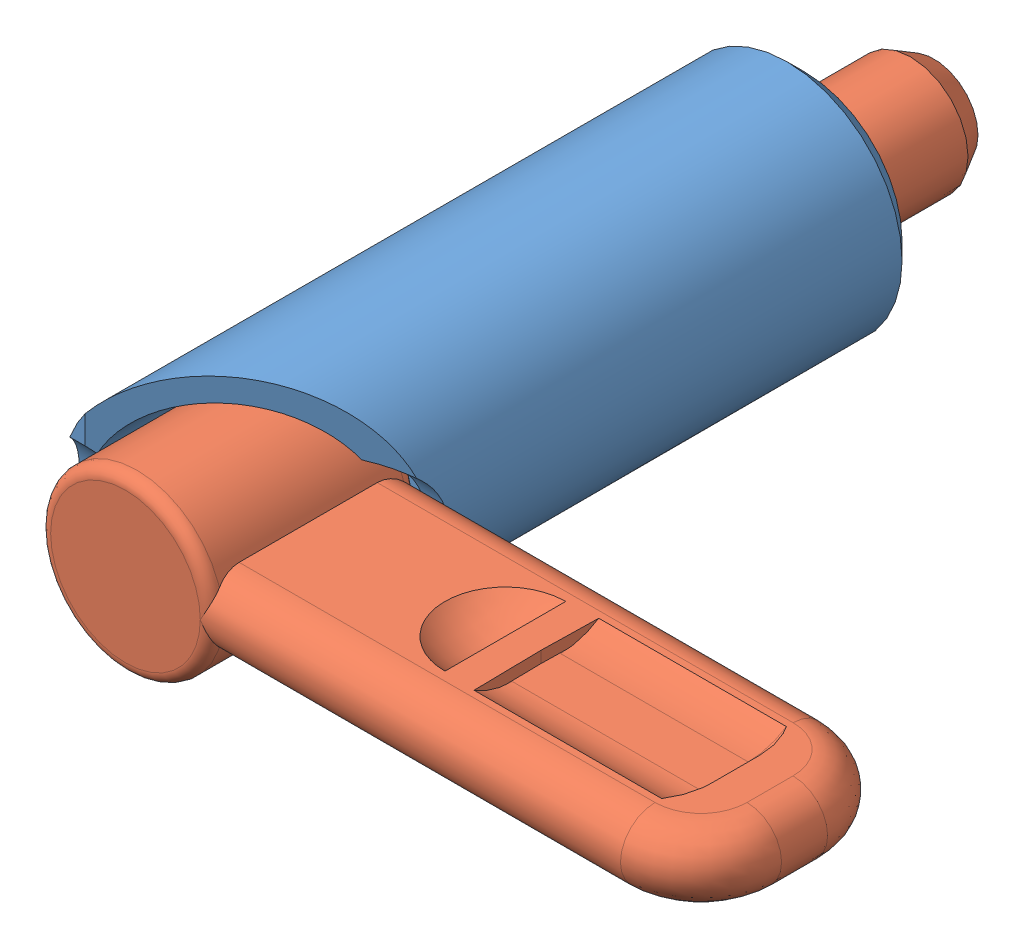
SolidWorks assembly GDX20L-10N.sldasm, configuration Default (file format 15000). Lengths in mm.
Overall size (60.01 20.01 71).
2 component instances, 2 part files, 0 mates.
Components (placement in the parent):
- GDX20L-10N_01-1: GDX20L-10N_01.SLDPRT [ﾃﾞﾌｫﾙﾄ] x (1 0 0) z (0 -1 0) size (20.02 57.18 20.01)
- GDX20L-10N_02-1: GDX20L-10N_02.SLDPRT [ﾃﾞﾌｫﾙﾄ] x (1 0 0) z (0 -1 0) size (57.5 71 15)
